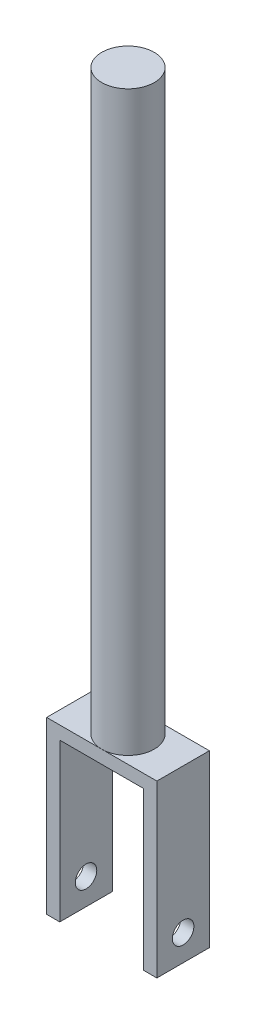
from build123d import *

# Parameters (mm, degrees)
SKETCH2_R               = 5
BOSS_EXTRUDE1_DEPTH     = 137.5
BOSS_EXTRUDE2_DEPTH     = 5
CUT_EXTRUDE1_DEPTH      = 138.990941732
CUT_EXTRUDE1_DEPTH_BACK = 138.990941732
SKETCH5_W               = 2.5
SKETCH5_H               = 5
BOSS_EXTRUDE3_DEPTH     = 10
CUT_EXTRUDE2_DEPTH      = 140.184230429
CUT_EXTRUDE2_DEPTH_BACK = 140.184230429
SKETCH6_R               = 2.05


with BuildPart() as part:
    # Sketch2 → Boss-Extrude1 (new body)
    with BuildSketch(Plane(origin=(0, 0, 0), x_dir=(1, 0, 0), z_dir=(0, 1, 0))):
        with Locations(Location((0, 0, 0), (0, 0, 270))):
            Circle(SKETCH2_R)
    extrude(amount=BOSS_EXTRUDE1_DEPTH)

    # Sketch3 → Boss-Extrude2 (add, symmetric)
    with BuildSketch(Plane.XY):
        Polygon((-8, 25), (0, 25), (0, 27.5), (-10.5, 27.5), (-10.5, 0), (-8, 0), align=None)
        Polygon((0, 27.5), (0, 25), (8, 25), (8, 0), (10.5, 0), (10.5, 27.5), align=None)
    extrude(amount=BOSS_EXTRUDE2_DEPTH, both=True)

    # Sketch3_3 → Cut-Extrude1 (cut, two sides: drawn at the far end of the back side and taken through both)
    with BuildSketch(Plane.XY.offset(-CUT_EXTRUDE1_DEPTH_BACK)):
        Polygon((8, 25), (0, 25), (-8, 25), (-8, 0), (-8, -1.971829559), (8, -1.971829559), (8, 0), align=None)
        Polygon((8, 25), (0, 25), (-8, 25), (-8, 0), (-8, -1.971829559), (8, -1.971829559), (8, 0), align=None)
    extrude(amount=CUT_EXTRUDE1_DEPTH + CUT_EXTRUDE1_DEPTH_BACK, mode=Mode.SUBTRACT)

    # Sketch5 → Boss-Extrude3 (add)
    with BuildSketch(Plane.XY.offset(5)):
        with Locations((-9.25, -2.5)):
            Rectangle(SKETCH5_W, SKETCH5_H)
        with Locations((9.25, -2.5)):
            Rectangle(SKETCH5_W, SKETCH5_H)
    extrude(amount=-BOSS_EXTRUDE3_DEPTH)

    # Sketch6 → Cut-Extrude2 (cut, two sides: drawn at the far end of the back side and taken through both)
    with BuildSketch(Plane.ZY.offset(10.5).offset(-CUT_EXTRUDE2_DEPTH_BACK)):
        Circle(SKETCH6_R)
    extrude(amount=CUT_EXTRUDE2_DEPTH + CUT_EXTRUDE2_DEPTH_BACK, mode=Mode.SUBTRACT)


solid = part.part
